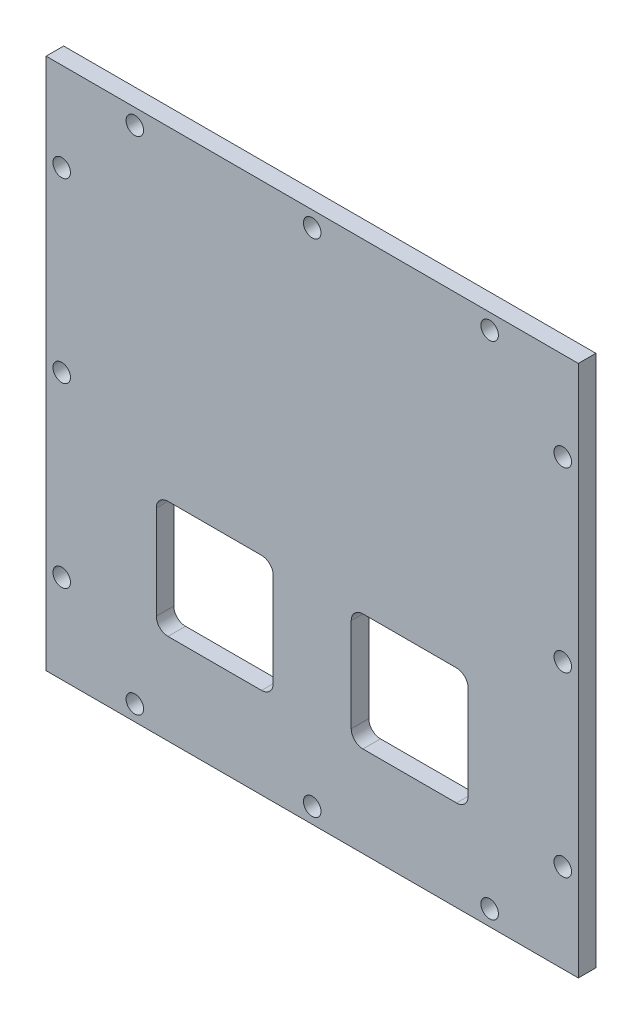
ISO-10303-21;
HEADER;
FILE_DESCRIPTION(('STEP AP214'),'2;1');
FILE_NAME('part.step','',(''),(''),'','','');
FILE_SCHEMA(('AUTOMOTIVE_DESIGN { 1 0 10303 214 1 1 1 1 }'));
ENDSEC;
DATA;
#1=APPLICATION_CONTEXT('core data for automotive mechanical design processes');
#2=APPLICATION_PROTOCOL_DEFINITION('international standard','automotive_design',2000,#1);
#3=PRODUCT_CONTEXT('',#1,'mechanical');
#4=PRODUCT('Part','Part','',(#3));
#5=PRODUCT_RELATED_PRODUCT_CATEGORY('part','',(#4));
#6=PRODUCT_DEFINITION_FORMATION('','',#4);
#7=PRODUCT_DEFINITION_CONTEXT('part definition',#1,'design');
#8=PRODUCT_DEFINITION('design','',#6,#7);
#9=PRODUCT_DEFINITION_SHAPE('','',#8);
#10=(LENGTH_UNIT() NAMED_UNIT(*) SI_UNIT(.MILLI.,.METRE.));
#11=(NAMED_UNIT(*) PLANE_ANGLE_UNIT() SI_UNIT($,.RADIAN.));
#12=(NAMED_UNIT(*) SI_UNIT($,.STERADIAN.) SOLID_ANGLE_UNIT());
#13=UNCERTAINTY_MEASURE_WITH_UNIT(LENGTH_MEASURE(1.E-05),#10,'distance_accuracy_value','');
#14=(GEOMETRIC_REPRESENTATION_CONTEXT(3) GLOBAL_UNCERTAINTY_ASSIGNED_CONTEXT((#13)) GLOBAL_UNIT_ASSIGNED_CONTEXT((#10,
#11,#12)) REPRESENTATION_CONTEXT('',''));
#15=CARTESIAN_POINT('',(0.,0.,0.));
#16=DIRECTION('',(0.,0.,1.));
#17=DIRECTION('',(1.,0.,0.));
#18=AXIS2_PLACEMENT_3D('',#15,#16,#17);
#19=CARTESIAN_POINT('',(-68.25,68.25,4.5));
#20=DIRECTION('',(1.,0.,0.));
#21=DIRECTION('',(0.,0.,-1.));
#22=AXIS2_PLACEMENT_3D('',#19,#20,#21);
#23=PLANE('',#22);
#24=DIRECTION('',(0.,-1.,0.));
#25=VECTOR('',#24,1.);
#26=CARTESIAN_POINT('',(-68.25,68.25,0.));
#27=LINE('',#26,#25);
#28=CARTESIAN_POINT('',(-68.25,68.25,0.));
#29=VERTEX_POINT('',#28);
#30=CARTESIAN_POINT('',(-68.25,-68.25,0.));
#31=VERTEX_POINT('',#30);
#32=EDGE_CURVE('E362',#29,#31,#27,.T.);
#33=ORIENTED_EDGE('',*,*,#32,.T.);
#34=DIRECTION('',(0.,0.,-1.));
#35=VECTOR('',#34,1.);
#36=CARTESIAN_POINT('',(-68.25,-68.25,4.5));
#37=LINE('',#36,#35);
#38=CARTESIAN_POINT('',(-68.25,-68.25,4.5));
#39=VERTEX_POINT('',#38);
#40=EDGE_CURVE('E11',#39,#31,#37,.T.);
#41=ORIENTED_EDGE('',*,*,#40,.F.);
#42=DIRECTION('',(0.,-1.,0.));
#43=VECTOR('',#42,1.);
#44=CARTESIAN_POINT('',(-68.25,68.25,4.5));
#45=LINE('',#44,#43);
#46=CARTESIAN_POINT('',(-68.25,68.25,4.5));
#47=VERTEX_POINT('',#46);
#48=EDGE_CURVE('E363',#47,#39,#45,.T.);
#49=ORIENTED_EDGE('',*,*,#48,.F.);
#50=DIRECTION('',(0.,0.,-1.));
#51=VECTOR('',#50,1.);
#52=CARTESIAN_POINT('',(-68.25,68.25,4.5));
#53=LINE('',#52,#51);
#54=EDGE_CURVE('E373',#47,#29,#53,.T.);
#55=ORIENTED_EDGE('',*,*,#54,.T.);
#56=EDGE_LOOP('',(#33,#41,#49,#55));
#57=FACE_BOUND('',#56,.T.);
#58=ADVANCED_FACE('F33',(#57),#23,.F.);
#59=CARTESIAN_POINT('',(-68.25,-68.25,4.5));
#60=DIRECTION('',(0.,1.,0.));
#61=DIRECTION('',(0.,0.,1.));
#62=AXIS2_PLACEMENT_3D('',#59,#60,#61);
#63=PLANE('',#62);
#64=DIRECTION('',(1.,0.,0.));
#65=VECTOR('',#64,1.);
#66=CARTESIAN_POINT('',(-68.25,-68.25,0.));
#67=LINE('',#66,#65);
#68=CARTESIAN_POINT('',(68.25,-68.25,0.));
#69=VERTEX_POINT('',#68);
#70=EDGE_CURVE('E376',#31,#69,#67,.T.);
#71=ORIENTED_EDGE('',*,*,#70,.T.);
#72=DIRECTION('',(0.,0.,-1.));
#73=VECTOR('',#72,1.);
#74=CARTESIAN_POINT('',(68.25,-68.25,4.5));
#75=LINE('',#74,#73);
#76=CARTESIAN_POINT('',(68.25,-68.25,4.5));
#77=VERTEX_POINT('',#76);
#78=EDGE_CURVE('E40',#77,#69,#75,.T.);
#79=ORIENTED_EDGE('',*,*,#78,.F.);
#80=DIRECTION('',(1.,0.,0.));
#81=VECTOR('',#80,1.);
#82=CARTESIAN_POINT('',(-68.25,-68.25,4.5));
#83=LINE('',#82,#81);
#84=EDGE_CURVE('E366',#39,#77,#83,.T.);
#85=ORIENTED_EDGE('',*,*,#84,.F.);
#86=ORIENTED_EDGE('',*,*,#40,.T.);
#87=EDGE_LOOP('',(#71,#79,#85,#86));
#88=FACE_BOUND('',#87,.T.);
#89=ADVANCED_FACE('F405',(#88),#63,.F.);
#90=CARTESIAN_POINT('',(68.25,68.25,4.5));
#91=DIRECTION('',(-1.,0.,0.));
#92=DIRECTION('',(0.,0.,1.));
#93=AXIS2_PLACEMENT_3D('',#90,#91,#92);
#94=PLANE('',#93);
#95=DIRECTION('',(0.,1.,0.));
#96=VECTOR('',#95,1.);
#97=CARTESIAN_POINT('',(68.25,68.25,0.));
#98=LINE('',#97,#96);
#99=CARTESIAN_POINT('',(68.25,68.25,0.));
#100=VERTEX_POINT('',#99);
#101=EDGE_CURVE('E378',#69,#100,#98,.T.);
#102=ORIENTED_EDGE('',*,*,#101,.T.);
#103=DIRECTION('',(0.,0.,-1.));
#104=VECTOR('',#103,1.);
#105=CARTESIAN_POINT('',(68.25,68.25,4.5));
#106=LINE('',#105,#104);
#107=CARTESIAN_POINT('',(68.25,68.25,4.5));
#108=VERTEX_POINT('',#107);
#109=EDGE_CURVE('E383',#108,#100,#106,.T.);
#110=ORIENTED_EDGE('',*,*,#109,.F.);
#111=DIRECTION('',(0.,1.,0.));
#112=VECTOR('',#111,1.);
#113=CARTESIAN_POINT('',(68.25,68.25,4.5));
#114=LINE('',#113,#112);
#115=EDGE_CURVE('E369',#77,#108,#114,.T.);
#116=ORIENTED_EDGE('',*,*,#115,.F.);
#117=ORIENTED_EDGE('',*,*,#78,.T.);
#118=EDGE_LOOP('',(#102,#110,#116,#117));
#119=FACE_BOUND('',#118,.T.);
#120=ADVANCED_FACE('F390',(#119),#94,.F.);
#121=CARTESIAN_POINT('',(-68.25,68.25,4.5));
#122=DIRECTION('',(0.,-1.,0.));
#123=DIRECTION('',(0.,0.,-1.));
#124=AXIS2_PLACEMENT_3D('',#121,#122,#123);
#125=PLANE('',#124);
#126=DIRECTION('',(-1.,0.,0.));
#127=VECTOR('',#126,1.);
#128=CARTESIAN_POINT('',(-68.25,68.25,0.));
#129=LINE('',#128,#127);
#130=EDGE_CURVE('E367',#100,#29,#129,.T.);
#131=ORIENTED_EDGE('',*,*,#130,.T.);
#132=ORIENTED_EDGE('',*,*,#54,.F.);
#133=DIRECTION('',(-1.,0.,0.));
#134=VECTOR('',#133,1.);
#135=CARTESIAN_POINT('',(-68.25,68.25,4.5));
#136=LINE('',#135,#134);
#137=EDGE_CURVE('E371',#108,#47,#136,.T.);
#138=ORIENTED_EDGE('',*,*,#137,.F.);
#139=ORIENTED_EDGE('',*,*,#109,.T.);
#140=EDGE_LOOP('',(#131,#132,#138,#139));
#141=FACE_BOUND('',#140,.T.);
#142=ADVANCED_FACE('F398',(#141),#125,.F.);
#143=CARTESIAN_POINT('',(0.,0.,4.5));
#144=DIRECTION('',(0.,0.,1.));
#145=DIRECTION('',(1.,0.,0.));
#146=AXIS2_PLACEMENT_3D('',#143,#144,#145);
#147=PLANE('',#146);
#148=CARTESIAN_POINT('',(-13.,-18.,4.5));
#149=DIRECTION('',(0.,0.,1.));
#150=DIRECTION('',(-1.,0.,0.));
#151=AXIS2_PLACEMENT_3D('',#148,#149,#150);
#152=CIRCLE('',#151,3.);
#153=CARTESIAN_POINT('',(-10.,-18.,4.5));
#154=VERTEX_POINT('',#153);
#155=CARTESIAN_POINT('',(-13.,-15.,4.5));
#156=VERTEX_POINT('',#155);
#157=EDGE_CURVE('E47',#154,#156,#152,.T.);
#158=ORIENTED_EDGE('',*,*,#157,.F.);
#159=DIRECTION('',(0.,1.,0.));
#160=VECTOR('',#159,1.);
#161=CARTESIAN_POINT('',(-10.,-18.,4.5));
#162=LINE('',#161,#160);
#163=CARTESIAN_POINT('',(-10.,-42.,4.5));
#164=VERTEX_POINT('',#163);
#165=EDGE_CURVE('E177',#164,#154,#162,.T.);
#166=ORIENTED_EDGE('',*,*,#165,.F.);
#167=CARTESIAN_POINT('',(-13.,-42.,4.5));
#168=DIRECTION('',(0.,0.,1.));
#169=DIRECTION('',(1.,0.,0.));
#170=AXIS2_PLACEMENT_3D('',#167,#168,#169);
#171=CIRCLE('',#170,3.);
#172=CARTESIAN_POINT('',(-13.,-45.,4.5));
#173=VERTEX_POINT('',#172);
#174=EDGE_CURVE('E211',#173,#164,#171,.T.);
#175=ORIENTED_EDGE('',*,*,#174,.F.);
#176=DIRECTION('',(1.,0.,0.));
#177=VECTOR('',#176,1.);
#178=CARTESIAN_POINT('',(-37.,-45.,4.5));
#179=LINE('',#178,#177);
#180=CARTESIAN_POINT('',(-37.,-45.,4.5));
#181=VERTEX_POINT('',#180);
#182=EDGE_CURVE('E208',#181,#173,#179,.T.);
#183=ORIENTED_EDGE('',*,*,#182,.F.);
#184=CARTESIAN_POINT('',(-37.,-42.,4.5));
#185=DIRECTION('',(0.,0.,1.));
#186=DIRECTION('',(1.,0.,0.));
#187=AXIS2_PLACEMENT_3D('',#184,#185,#186);
#188=CIRCLE('',#187,3.00000000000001);
#189=CARTESIAN_POINT('',(-40.,-42.,4.5));
#190=VERTEX_POINT('',#189);
#191=EDGE_CURVE('E205',#190,#181,#188,.T.);
#192=ORIENTED_EDGE('',*,*,#191,.F.);
#193=DIRECTION('',(0.,-1.,0.));
#194=VECTOR('',#193,1.);
#195=CARTESIAN_POINT('',(-40.,-18.,4.5));
#196=LINE('',#195,#194);
#197=CARTESIAN_POINT('',(-40.,-18.,4.5));
#198=VERTEX_POINT('',#197);
#199=EDGE_CURVE('E202',#198,#190,#196,.T.);
#200=ORIENTED_EDGE('',*,*,#199,.F.);
#201=CARTESIAN_POINT('',(-37.,-18.,4.5));
#202=DIRECTION('',(0.,0.,1.));
#203=DIRECTION('',(1.,0.,0.));
#204=AXIS2_PLACEMENT_3D('',#201,#202,#203);
#205=CIRCLE('',#204,3.);
#206=CARTESIAN_POINT('',(-37.,-15.,4.5));
#207=VERTEX_POINT('',#206);
#208=EDGE_CURVE('E199',#207,#198,#205,.T.);
#209=ORIENTED_EDGE('',*,*,#208,.F.);
#210=DIRECTION('',(-1.,0.,0.));
#211=VECTOR('',#210,1.);
#212=CARTESIAN_POINT('',(-37.,-15.,4.5));
#213=LINE('',#212,#211);
#214=EDGE_CURVE('E192',#156,#207,#213,.T.);
#215=ORIENTED_EDGE('',*,*,#214,.F.);
#216=EDGE_LOOP('',(#158,#166,#175,#183,#192,#200,#209,#215));
#217=FACE_BOUND('',#216,.T.);
#218=CARTESIAN_POINT('',(37.,-18.,4.5));
#219=DIRECTION('',(0.,0.,1.));
#220=DIRECTION('',(1.,0.,0.));
#221=AXIS2_PLACEMENT_3D('',#218,#219,#220);
#222=CIRCLE('',#221,3.);
#223=CARTESIAN_POINT('',(40.,-18.,4.5));
#224=VERTEX_POINT('',#223);
#225=CARTESIAN_POINT('',(37.,-15.,4.5));
#226=VERTEX_POINT('',#225);
#227=EDGE_CURVE('E247',#224,#226,#222,.T.);
#228=ORIENTED_EDGE('',*,*,#227,.F.);
#229=DIRECTION('',(0.,1.,0.));
#230=VECTOR('',#229,1.);
#231=CARTESIAN_POINT('',(40.,-18.,4.5));
#232=LINE('',#231,#230);
#233=CARTESIAN_POINT('',(40.,-42.,4.5));
#234=VERTEX_POINT('',#233);
#235=EDGE_CURVE('E267',#234,#224,#232,.T.);
#236=ORIENTED_EDGE('',*,*,#235,.F.);
#237=CARTESIAN_POINT('',(37.,-42.,4.5));
#238=DIRECTION('',(0.,0.,1.));
#239=DIRECTION('',(-1.,0.,0.));
#240=AXIS2_PLACEMENT_3D('',#237,#238,#239);
#241=CIRCLE('',#240,3.00000000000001);
#242=CARTESIAN_POINT('',(37.,-45.,4.5));
#243=VERTEX_POINT('',#242);
#244=EDGE_CURVE('E264',#243,#234,#241,.T.);
#245=ORIENTED_EDGE('',*,*,#244,.F.);
#246=DIRECTION('',(1.,0.,0.));
#247=VECTOR('',#246,1.);
#248=CARTESIAN_POINT('',(37.,-45.,4.5));
#249=LINE('',#248,#247);
#250=CARTESIAN_POINT('',(13.,-45.,4.5));
#251=VERTEX_POINT('',#250);
#252=EDGE_CURVE('E261',#251,#243,#249,.T.);
#253=ORIENTED_EDGE('',*,*,#252,.F.);
#254=CARTESIAN_POINT('',(13.,-42.,4.5));
#255=DIRECTION('',(0.,0.,1.));
#256=DIRECTION('',(1.,0.,0.));
#257=AXIS2_PLACEMENT_3D('',#254,#255,#256);
#258=CIRCLE('',#257,3.);
#259=CARTESIAN_POINT('',(10.,-42.,4.5));
#260=VERTEX_POINT('',#259);
#261=EDGE_CURVE('E258',#260,#251,#258,.T.);
#262=ORIENTED_EDGE('',*,*,#261,.F.);
#263=DIRECTION('',(0.,-1.,0.));
#264=VECTOR('',#263,1.);
#265=CARTESIAN_POINT('',(10.,-18.,4.5));
#266=LINE('',#265,#264);
#267=CARTESIAN_POINT('',(10.,-18.,4.5));
#268=VERTEX_POINT('',#267);
#269=EDGE_CURVE('E255',#268,#260,#266,.T.);
#270=ORIENTED_EDGE('',*,*,#269,.F.);
#271=CARTESIAN_POINT('',(13.,-18.,4.5));
#272=DIRECTION('',(0.,0.,1.));
#273=DIRECTION('',(1.,0.,0.));
#274=AXIS2_PLACEMENT_3D('',#271,#272,#273);
#275=CIRCLE('',#274,3.);
#276=CARTESIAN_POINT('',(13.,-15.,4.5));
#277=VERTEX_POINT('',#276);
#278=EDGE_CURVE('E252',#277,#268,#275,.T.);
#279=ORIENTED_EDGE('',*,*,#278,.F.);
#280=DIRECTION('',(-1.,0.,0.));
#281=VECTOR('',#280,1.);
#282=CARTESIAN_POINT('',(37.,-15.,4.5));
#283=LINE('',#282,#281);
#284=EDGE_CURVE('E249',#226,#277,#283,.T.);
#285=ORIENTED_EDGE('',*,*,#284,.F.);
#286=EDGE_LOOP('',(#228,#236,#245,#253,#262,#270,#279,#285));
#287=FACE_BOUND('',#286,.T.);
#288=CARTESIAN_POINT('',(-64.25,45.5,4.5));
#289=DIRECTION('',(0.,0.,1.));
#290=DIRECTION('',(1.,0.,0.));
#291=AXIS2_PLACEMENT_3D('',#288,#289,#290);
#292=CIRCLE('',#291,2.25);
#293=CARTESIAN_POINT('',(-62.,45.5,4.5));
#294=VERTEX_POINT('',#293);
#295=EDGE_CURVE('E290',#294,#294,#292,.T.);
#296=ORIENTED_EDGE('',*,*,#295,.F.);
#297=EDGE_LOOP('',(#296));
#298=FACE_BOUND('',#297,.T.);
#299=CARTESIAN_POINT('',(-64.25,0.,4.5));
#300=DIRECTION('',(0.,0.,1.));
#301=DIRECTION('',(1.,0.,0.));
#302=AXIS2_PLACEMENT_3D('',#299,#300,#301);
#303=CIRCLE('',#302,2.25);
#304=CARTESIAN_POINT('',(-62.,0.,4.5));
#305=VERTEX_POINT('',#304);
#306=EDGE_CURVE('E296',#305,#305,#303,.T.);
#307=ORIENTED_EDGE('',*,*,#306,.F.);
#308=EDGE_LOOP('',(#307));
#309=FACE_BOUND('',#308,.T.);
#310=CARTESIAN_POINT('',(-64.25,-45.5,4.5));
#311=DIRECTION('',(0.,0.,1.));
#312=DIRECTION('',(1.,0.,0.));
#313=AXIS2_PLACEMENT_3D('',#310,#311,#312);
#314=CIRCLE('',#313,2.25);
#315=CARTESIAN_POINT('',(-62.,-45.5,4.5));
#316=VERTEX_POINT('',#315);
#317=EDGE_CURVE('E302',#316,#316,#314,.T.);
#318=ORIENTED_EDGE('',*,*,#317,.F.);
#319=EDGE_LOOP('',(#318));
#320=FACE_BOUND('',#319,.T.);
#321=CARTESIAN_POINT('',(-45.5,64.25,4.5));
#322=DIRECTION('',(0.,0.,1.));
#323=DIRECTION('',(1.,0.,0.));
#324=AXIS2_PLACEMENT_3D('',#321,#322,#323);
#325=CIRCLE('',#324,2.25);
#326=CARTESIAN_POINT('',(-43.25,64.25,4.5));
#327=VERTEX_POINT('',#326);
#328=EDGE_CURVE('E308',#327,#327,#325,.T.);
#329=ORIENTED_EDGE('',*,*,#328,.F.);
#330=EDGE_LOOP('',(#329));
#331=FACE_BOUND('',#330,.T.);
#332=CARTESIAN_POINT('',(0.,64.25,4.5));
#333=DIRECTION('',(0.,0.,1.));
#334=DIRECTION('',(1.,0.,0.));
#335=AXIS2_PLACEMENT_3D('',#332,#333,#334);
#336=CIRCLE('',#335,2.25);
#337=CARTESIAN_POINT('',(2.25,64.25,4.5));
#338=VERTEX_POINT('',#337);
#339=EDGE_CURVE('E314',#338,#338,#336,.T.);
#340=ORIENTED_EDGE('',*,*,#339,.F.);
#341=EDGE_LOOP('',(#340));
#342=FACE_BOUND('',#341,.T.);
#343=CARTESIAN_POINT('',(45.5,64.25,4.5));
#344=DIRECTION('',(0.,0.,1.));
#345=DIRECTION('',(1.,0.,0.));
#346=AXIS2_PLACEMENT_3D('',#343,#344,#345);
#347=CIRCLE('',#346,2.25);
#348=CARTESIAN_POINT('',(47.75,64.25,4.5));
#349=VERTEX_POINT('',#348);
#350=EDGE_CURVE('E320',#349,#349,#347,.T.);
#351=ORIENTED_EDGE('',*,*,#350,.F.);
#352=EDGE_LOOP('',(#351));
#353=FACE_BOUND('',#352,.T.);
#354=CARTESIAN_POINT('',(64.25,-45.5,4.5));
#355=DIRECTION('',(0.,0.,1.));
#356=DIRECTION('',(1.,0.,0.));
#357=AXIS2_PLACEMENT_3D('',#354,#355,#356);
#358=CIRCLE('',#357,2.25);
#359=CARTESIAN_POINT('',(66.5,-45.5,4.5));
#360=VERTEX_POINT('',#359);
#361=EDGE_CURVE('E326',#360,#360,#358,.T.);
#362=ORIENTED_EDGE('',*,*,#361,.F.);
#363=EDGE_LOOP('',(#362));
#364=FACE_BOUND('',#363,.T.);
#365=CARTESIAN_POINT('',(64.25,0.,4.5));
#366=DIRECTION('',(0.,0.,1.));
#367=DIRECTION('',(1.,0.,0.));
#368=AXIS2_PLACEMENT_3D('',#365,#366,#367);
#369=CIRCLE('',#368,2.25);
#370=CARTESIAN_POINT('',(66.5,0.,4.5));
#371=VERTEX_POINT('',#370);
#372=EDGE_CURVE('E332',#371,#371,#369,.T.);
#373=ORIENTED_EDGE('',*,*,#372,.F.);
#374=EDGE_LOOP('',(#373));
#375=FACE_BOUND('',#374,.T.);
#376=CARTESIAN_POINT('',(64.25,45.5,4.5));
#377=DIRECTION('',(0.,0.,1.));
#378=DIRECTION('',(1.,0.,0.));
#379=AXIS2_PLACEMENT_3D('',#376,#377,#378);
#380=CIRCLE('',#379,2.25);
#381=CARTESIAN_POINT('',(66.5,45.5,4.5));
#382=VERTEX_POINT('',#381);
#383=EDGE_CURVE('E338',#382,#382,#380,.T.);
#384=ORIENTED_EDGE('',*,*,#383,.F.);
#385=EDGE_LOOP('',(#384));
#386=FACE_BOUND('',#385,.T.);
#387=CARTESIAN_POINT('',(45.5,-64.25,4.5));
#388=DIRECTION('',(0.,0.,1.));
#389=DIRECTION('',(1.,0.,0.));
#390=AXIS2_PLACEMENT_3D('',#387,#388,#389);
#391=CIRCLE('',#390,2.25);
#392=CARTESIAN_POINT('',(47.75,-64.25,4.5));
#393=VERTEX_POINT('',#392);
#394=EDGE_CURVE('E344',#393,#393,#391,.T.);
#395=ORIENTED_EDGE('',*,*,#394,.F.);
#396=EDGE_LOOP('',(#395));
#397=FACE_BOUND('',#396,.T.);
#398=CARTESIAN_POINT('',(0.,-64.25,4.5));
#399=DIRECTION('',(0.,0.,1.));
#400=DIRECTION('',(1.,0.,0.));
#401=AXIS2_PLACEMENT_3D('',#398,#399,#400);
#402=CIRCLE('',#401,2.25);
#403=CARTESIAN_POINT('',(2.25,-64.25,4.5));
#404=VERTEX_POINT('',#403);
#405=EDGE_CURVE('E350',#404,#404,#402,.T.);
#406=ORIENTED_EDGE('',*,*,#405,.F.);
#407=EDGE_LOOP('',(#406));
#408=FACE_BOUND('',#407,.T.);
#409=CARTESIAN_POINT('',(-45.5,-64.25,4.5));
#410=DIRECTION('',(0.,0.,1.));
#411=DIRECTION('',(1.,0.,0.));
#412=AXIS2_PLACEMENT_3D('',#409,#410,#411);
#413=CIRCLE('',#412,2.25);
#414=CARTESIAN_POINT('',(-43.25,-64.25,4.5));
#415=VERTEX_POINT('',#414);
#416=EDGE_CURVE('E356',#415,#415,#413,.T.);
#417=ORIENTED_EDGE('',*,*,#416,.F.);
#418=EDGE_LOOP('',(#417));
#419=FACE_BOUND('',#418,.T.);
#420=ORIENTED_EDGE('',*,*,#48,.T.);
#421=ORIENTED_EDGE('',*,*,#84,.T.);
#422=ORIENTED_EDGE('',*,*,#115,.T.);
#423=ORIENTED_EDGE('',*,*,#137,.T.);
#424=EDGE_LOOP('',(#420,#421,#422,#423));
#425=FACE_BOUND('',#424,.T.);
#426=ADVANCED_FACE('F404',(#217,#287,#298,#309,#320,#331,#342,#353,#364,#375,#386,#397,#408,
#419,#425),#147,.T.);
#427=CARTESIAN_POINT('',(0.,0.,0.));
#428=DIRECTION('',(0.,0.,1.));
#429=DIRECTION('',(1.,0.,0.));
#430=AXIS2_PLACEMENT_3D('',#427,#428,#429);
#431=PLANE('',#430);
#432=DIRECTION('',(0.,-1.,0.));
#433=VECTOR('',#432,1.);
#434=CARTESIAN_POINT('',(-10.,-18.,0.));
#435=LINE('',#434,#433);
#436=CARTESIAN_POINT('',(-10.,-18.,0.));
#437=VERTEX_POINT('',#436);
#438=CARTESIAN_POINT('',(-10.,-42.,0.));
#439=VERTEX_POINT('',#438);
#440=EDGE_CURVE('E190',#437,#439,#435,.T.);
#441=ORIENTED_EDGE('',*,*,#440,.F.);
#442=CARTESIAN_POINT('',(-13.,-18.,0.));
#443=DIRECTION('',(0.,0.,1.));
#444=DIRECTION('',(1.,0.,0.));
#445=AXIS2_PLACEMENT_3D('',#442,#443,#444);
#446=CIRCLE('',#445,3.);
#447=CARTESIAN_POINT('',(-13.,-15.,0.));
#448=VERTEX_POINT('',#447);
#449=EDGE_CURVE('E171',#448,#437,#446,.F.);
#450=ORIENTED_EDGE('',*,*,#449,.F.);
#451=DIRECTION('',(1.,0.,0.));
#452=VECTOR('',#451,1.);
#453=CARTESIAN_POINT('',(-37.,-15.,0.));
#454=LINE('',#453,#452);
#455=CARTESIAN_POINT('',(-37.,-15.,0.));
#456=VERTEX_POINT('',#455);
#457=EDGE_CURVE('E180',#456,#448,#454,.T.);
#458=ORIENTED_EDGE('',*,*,#457,.F.);
#459=CARTESIAN_POINT('',(-37.,-18.,0.));
#460=DIRECTION('',(0.,0.,1.));
#461=DIRECTION('',(1.,0.,0.));
#462=AXIS2_PLACEMENT_3D('',#459,#460,#461);
#463=CIRCLE('',#462,3.);
#464=CARTESIAN_POINT('',(-40.,-18.,0.));
#465=VERTEX_POINT('',#464);
#466=EDGE_CURVE('E55',#465,#456,#463,.F.);
#467=ORIENTED_EDGE('',*,*,#466,.F.);
#468=DIRECTION('',(0.,1.,0.));
#469=VECTOR('',#468,1.);
#470=CARTESIAN_POINT('',(-40.,-18.,0.));
#471=LINE('',#470,#469);
#472=CARTESIAN_POINT('',(-40.,-42.,0.));
#473=VERTEX_POINT('',#472);
#474=EDGE_CURVE('E538',#473,#465,#471,.T.);
#475=ORIENTED_EDGE('',*,*,#474,.F.);
#476=CARTESIAN_POINT('',(-37.,-42.,0.));
#477=DIRECTION('',(0.,0.,1.));
#478=DIRECTION('',(1.,0.,0.));
#479=AXIS2_PLACEMENT_3D('',#476,#477,#478);
#480=CIRCLE('',#479,3.00000000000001);
#481=CARTESIAN_POINT('',(-37.,-45.,0.));
#482=VERTEX_POINT('',#481);
#483=EDGE_CURVE('E533',#482,#473,#480,.F.);
#484=ORIENTED_EDGE('',*,*,#483,.F.);
#485=DIRECTION('',(-1.,0.,0.));
#486=VECTOR('',#485,1.);
#487=CARTESIAN_POINT('',(-37.,-45.,0.));
#488=LINE('',#487,#486);
#489=CARTESIAN_POINT('',(-13.,-45.,0.));
#490=VERTEX_POINT('',#489);
#491=EDGE_CURVE('E532',#490,#482,#488,.T.);
#492=ORIENTED_EDGE('',*,*,#491,.F.);
#493=CARTESIAN_POINT('',(-13.,-42.,0.));
#494=DIRECTION('',(0.,0.,1.));
#495=DIRECTION('',(1.,0.,0.));
#496=AXIS2_PLACEMENT_3D('',#493,#494,#495);
#497=CIRCLE('',#496,3.);
#498=EDGE_CURVE('E194',#439,#490,#497,.F.);
#499=ORIENTED_EDGE('',*,*,#498,.F.);
#500=EDGE_LOOP('',(#441,#450,#458,#467,#475,#484,#492,#499));
#501=FACE_BOUND('',#500,.T.);
#502=DIRECTION('',(0.,-1.,0.));
#503=VECTOR('',#502,1.);
#504=CARTESIAN_POINT('',(40.,-18.,0.));
#505=LINE('',#504,#503);
#506=CARTESIAN_POINT('',(40.,-18.,0.));
#507=VERTEX_POINT('',#506);
#508=CARTESIAN_POINT('',(40.,-42.,0.));
#509=VERTEX_POINT('',#508);
#510=EDGE_CURVE('E241',#507,#509,#505,.T.);
#511=ORIENTED_EDGE('',*,*,#510,.F.);
#512=CARTESIAN_POINT('',(37.,-18.,0.));
#513=DIRECTION('',(0.,0.,1.));
#514=DIRECTION('',(1.,0.,0.));
#515=AXIS2_PLACEMENT_3D('',#512,#513,#514);
#516=CIRCLE('',#515,3.);
#517=CARTESIAN_POINT('',(37.,-15.,0.));
#518=VERTEX_POINT('',#517);
#519=EDGE_CURVE('E244',#518,#507,#516,.F.);
#520=ORIENTED_EDGE('',*,*,#519,.F.);
#521=DIRECTION('',(1.,0.,0.));
#522=VECTOR('',#521,1.);
#523=CARTESIAN_POINT('',(37.,-15.,0.));
#524=LINE('',#523,#522);
#525=CARTESIAN_POINT('',(13.,-15.,0.));
#526=VERTEX_POINT('',#525);
#527=EDGE_CURVE('E273',#526,#518,#524,.T.);
#528=ORIENTED_EDGE('',*,*,#527,.F.);
#529=CARTESIAN_POINT('',(13.,-18.,0.));
#530=DIRECTION('',(0.,0.,1.));
#531=DIRECTION('',(1.,0.,0.));
#532=AXIS2_PLACEMENT_3D('',#529,#530,#531);
#533=CIRCLE('',#532,3.);
#534=CARTESIAN_POINT('',(10.,-18.,0.));
#535=VERTEX_POINT('',#534);
#536=EDGE_CURVE('E183',#535,#526,#533,.F.);
#537=ORIENTED_EDGE('',*,*,#536,.F.);
#538=DIRECTION('',(0.,1.,0.));
#539=VECTOR('',#538,1.);
#540=CARTESIAN_POINT('',(10.,-18.,0.));
#541=LINE('',#540,#539);
#542=CARTESIAN_POINT('',(10.,-42.,0.));
#543=VERTEX_POINT('',#542);
#544=EDGE_CURVE('E229',#543,#535,#541,.T.);
#545=ORIENTED_EDGE('',*,*,#544,.F.);
#546=CARTESIAN_POINT('',(13.,-42.,0.));
#547=DIRECTION('',(0.,0.,1.));
#548=DIRECTION('',(1.,0.,0.));
#549=AXIS2_PLACEMENT_3D('',#546,#547,#548);
#550=CIRCLE('',#549,3.);
#551=CARTESIAN_POINT('',(13.,-45.,0.));
#552=VERTEX_POINT('',#551);
#553=EDGE_CURVE('E232',#552,#543,#550,.F.);
#554=ORIENTED_EDGE('',*,*,#553,.F.);
#555=DIRECTION('',(-1.,0.,0.));
#556=VECTOR('',#555,1.);
#557=CARTESIAN_POINT('',(37.,-45.,0.));
#558=LINE('',#557,#556);
#559=CARTESIAN_POINT('',(37.,-45.,0.));
#560=VERTEX_POINT('',#559);
#561=EDGE_CURVE('E235',#560,#552,#558,.T.);
#562=ORIENTED_EDGE('',*,*,#561,.F.);
#563=CARTESIAN_POINT('',(37.,-42.,0.));
#564=DIRECTION('',(0.,0.,1.));
#565=DIRECTION('',(1.,0.,0.));
#566=AXIS2_PLACEMENT_3D('',#563,#564,#565);
#567=CIRCLE('',#566,3.00000000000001);
#568=EDGE_CURVE('E238',#509,#560,#567,.F.);
#569=ORIENTED_EDGE('',*,*,#568,.F.);
#570=EDGE_LOOP('',(#511,#520,#528,#537,#545,#554,#562,#569));
#571=FACE_BOUND('',#570,.T.);
#572=CARTESIAN_POINT('',(-64.25,45.5,0.));
#573=DIRECTION('',(0.,0.,1.));
#574=DIRECTION('',(1.,0.,0.));
#575=AXIS2_PLACEMENT_3D('',#572,#573,#574);
#576=CIRCLE('',#575,2.25);
#577=CARTESIAN_POINT('',(-62.,45.5,0.));
#578=VERTEX_POINT('',#577);
#579=EDGE_CURVE('E293',#578,#578,#576,.T.);
#580=ORIENTED_EDGE('',*,*,#579,.T.);
#581=EDGE_LOOP('',(#580));
#582=FACE_BOUND('',#581,.T.);
#583=CARTESIAN_POINT('',(-64.25,0.,0.));
#584=DIRECTION('',(0.,0.,1.));
#585=DIRECTION('',(1.,0.,0.));
#586=AXIS2_PLACEMENT_3D('',#583,#584,#585);
#587=CIRCLE('',#586,2.25);
#588=CARTESIAN_POINT('',(-62.,0.,0.));
#589=VERTEX_POINT('',#588);
#590=EDGE_CURVE('E299',#589,#589,#587,.T.);
#591=ORIENTED_EDGE('',*,*,#590,.T.);
#592=EDGE_LOOP('',(#591));
#593=FACE_BOUND('',#592,.T.);
#594=CARTESIAN_POINT('',(-64.25,-45.5,0.));
#595=DIRECTION('',(0.,0.,1.));
#596=DIRECTION('',(1.,0.,0.));
#597=AXIS2_PLACEMENT_3D('',#594,#595,#596);
#598=CIRCLE('',#597,2.25);
#599=CARTESIAN_POINT('',(-62.,-45.5,0.));
#600=VERTEX_POINT('',#599);
#601=EDGE_CURVE('E305',#600,#600,#598,.T.);
#602=ORIENTED_EDGE('',*,*,#601,.T.);
#603=EDGE_LOOP('',(#602));
#604=FACE_BOUND('',#603,.T.);
#605=CARTESIAN_POINT('',(-45.5,64.25,0.));
#606=DIRECTION('',(0.,0.,1.));
#607=DIRECTION('',(1.,0.,0.));
#608=AXIS2_PLACEMENT_3D('',#605,#606,#607);
#609=CIRCLE('',#608,2.25);
#610=CARTESIAN_POINT('',(-43.25,64.25,0.));
#611=VERTEX_POINT('',#610);
#612=EDGE_CURVE('E311',#611,#611,#609,.T.);
#613=ORIENTED_EDGE('',*,*,#612,.T.);
#614=EDGE_LOOP('',(#613));
#615=FACE_BOUND('',#614,.T.);
#616=CARTESIAN_POINT('',(0.,64.25,0.));
#617=DIRECTION('',(0.,0.,1.));
#618=DIRECTION('',(1.,0.,0.));
#619=AXIS2_PLACEMENT_3D('',#616,#617,#618);
#620=CIRCLE('',#619,2.25);
#621=CARTESIAN_POINT('',(2.25,64.25,0.));
#622=VERTEX_POINT('',#621);
#623=EDGE_CURVE('E317',#622,#622,#620,.T.);
#624=ORIENTED_EDGE('',*,*,#623,.T.);
#625=EDGE_LOOP('',(#624));
#626=FACE_BOUND('',#625,.T.);
#627=CARTESIAN_POINT('',(45.5,64.25,0.));
#628=DIRECTION('',(0.,0.,1.));
#629=DIRECTION('',(1.,0.,0.));
#630=AXIS2_PLACEMENT_3D('',#627,#628,#629);
#631=CIRCLE('',#630,2.25);
#632=CARTESIAN_POINT('',(47.75,64.25,0.));
#633=VERTEX_POINT('',#632);
#634=EDGE_CURVE('E323',#633,#633,#631,.T.);
#635=ORIENTED_EDGE('',*,*,#634,.T.);
#636=EDGE_LOOP('',(#635));
#637=FACE_BOUND('',#636,.T.);
#638=CARTESIAN_POINT('',(64.25,-45.5,0.));
#639=DIRECTION('',(0.,0.,1.));
#640=DIRECTION('',(1.,0.,0.));
#641=AXIS2_PLACEMENT_3D('',#638,#639,#640);
#642=CIRCLE('',#641,2.25);
#643=CARTESIAN_POINT('',(66.5,-45.5,0.));
#644=VERTEX_POINT('',#643);
#645=EDGE_CURVE('E329',#644,#644,#642,.T.);
#646=ORIENTED_EDGE('',*,*,#645,.T.);
#647=EDGE_LOOP('',(#646));
#648=FACE_BOUND('',#647,.T.);
#649=CARTESIAN_POINT('',(64.25,0.,0.));
#650=DIRECTION('',(0.,0.,1.));
#651=DIRECTION('',(1.,0.,0.));
#652=AXIS2_PLACEMENT_3D('',#649,#650,#651);
#653=CIRCLE('',#652,2.25);
#654=CARTESIAN_POINT('',(66.5,0.,0.));
#655=VERTEX_POINT('',#654);
#656=EDGE_CURVE('E335',#655,#655,#653,.T.);
#657=ORIENTED_EDGE('',*,*,#656,.T.);
#658=EDGE_LOOP('',(#657));
#659=FACE_BOUND('',#658,.T.);
#660=CARTESIAN_POINT('',(64.25,45.5,0.));
#661=DIRECTION('',(0.,0.,1.));
#662=DIRECTION('',(1.,0.,0.));
#663=AXIS2_PLACEMENT_3D('',#660,#661,#662);
#664=CIRCLE('',#663,2.25);
#665=CARTESIAN_POINT('',(66.5,45.5,0.));
#666=VERTEX_POINT('',#665);
#667=EDGE_CURVE('E341',#666,#666,#664,.T.);
#668=ORIENTED_EDGE('',*,*,#667,.T.);
#669=EDGE_LOOP('',(#668));
#670=FACE_BOUND('',#669,.T.);
#671=CARTESIAN_POINT('',(45.5,-64.25,0.));
#672=DIRECTION('',(0.,0.,1.));
#673=DIRECTION('',(1.,0.,0.));
#674=AXIS2_PLACEMENT_3D('',#671,#672,#673);
#675=CIRCLE('',#674,2.25);
#676=CARTESIAN_POINT('',(47.75,-64.25,0.));
#677=VERTEX_POINT('',#676);
#678=EDGE_CURVE('E347',#677,#677,#675,.T.);
#679=ORIENTED_EDGE('',*,*,#678,.T.);
#680=EDGE_LOOP('',(#679));
#681=FACE_BOUND('',#680,.T.);
#682=CARTESIAN_POINT('',(0.,-64.25,0.));
#683=DIRECTION('',(0.,0.,1.));
#684=DIRECTION('',(1.,0.,0.));
#685=AXIS2_PLACEMENT_3D('',#682,#683,#684);
#686=CIRCLE('',#685,2.25);
#687=CARTESIAN_POINT('',(2.25,-64.25,0.));
#688=VERTEX_POINT('',#687);
#689=EDGE_CURVE('E353',#688,#688,#686,.T.);
#690=ORIENTED_EDGE('',*,*,#689,.T.);
#691=EDGE_LOOP('',(#690));
#692=FACE_BOUND('',#691,.T.);
#693=CARTESIAN_POINT('',(-45.5,-64.25,0.));
#694=DIRECTION('',(0.,0.,1.));
#695=DIRECTION('',(1.,0.,0.));
#696=AXIS2_PLACEMENT_3D('',#693,#694,#695);
#697=CIRCLE('',#696,2.25);
#698=CARTESIAN_POINT('',(-43.25,-64.25,0.));
#699=VERTEX_POINT('',#698);
#700=EDGE_CURVE('E359',#699,#699,#697,.T.);
#701=ORIENTED_EDGE('',*,*,#700,.T.);
#702=EDGE_LOOP('',(#701));
#703=FACE_BOUND('',#702,.T.);
#704=ORIENTED_EDGE('',*,*,#32,.F.);
#705=ORIENTED_EDGE('',*,*,#130,.F.);
#706=ORIENTED_EDGE('',*,*,#101,.F.);
#707=ORIENTED_EDGE('',*,*,#70,.F.);
#708=EDGE_LOOP('',(#704,#705,#706,#707));
#709=FACE_BOUND('',#708,.T.);
#710=ADVANCED_FACE('F186',(#501,#571,#582,#593,#604,#615,#626,#637,#648,#659,#670,#681,#692,
#703,#709),#431,.F.);
#711=CARTESIAN_POINT('',(-45.5,-64.25,4.5));
#712=DIRECTION('',(0.,0.,1.));
#713=DIRECTION('',(1.,0.,0.));
#714=AXIS2_PLACEMENT_3D('',#711,#712,#713);
#715=CYLINDRICAL_SURFACE('',#714,2.25);
#716=ORIENTED_EDGE('',*,*,#700,.F.);
#717=EDGE_LOOP('',(#716));
#718=FACE_BOUND('',#717,.T.);
#719=ORIENTED_EDGE('',*,*,#416,.T.);
#720=EDGE_LOOP('',(#719));
#721=FACE_BOUND('',#720,.T.);
#722=ADVANCED_FACE('F417',(#718,#721),#715,.F.);
#723=CARTESIAN_POINT('',(0.,-64.25,4.5));
#724=DIRECTION('',(0.,0.,1.));
#725=DIRECTION('',(1.,0.,0.));
#726=AXIS2_PLACEMENT_3D('',#723,#724,#725);
#727=CYLINDRICAL_SURFACE('',#726,2.25);
#728=ORIENTED_EDGE('',*,*,#689,.F.);
#729=EDGE_LOOP('',(#728));
#730=FACE_BOUND('',#729,.T.);
#731=ORIENTED_EDGE('',*,*,#405,.T.);
#732=EDGE_LOOP('',(#731));
#733=FACE_BOUND('',#732,.T.);
#734=ADVANCED_FACE('F423',(#730,#733),#727,.F.);
#735=CARTESIAN_POINT('',(45.5,-64.25,4.5));
#736=DIRECTION('',(0.,0.,1.));
#737=DIRECTION('',(1.,0.,0.));
#738=AXIS2_PLACEMENT_3D('',#735,#736,#737);
#739=CYLINDRICAL_SURFACE('',#738,2.25);
#740=ORIENTED_EDGE('',*,*,#678,.F.);
#741=EDGE_LOOP('',(#740));
#742=FACE_BOUND('',#741,.T.);
#743=ORIENTED_EDGE('',*,*,#394,.T.);
#744=EDGE_LOOP('',(#743));
#745=FACE_BOUND('',#744,.T.);
#746=ADVANCED_FACE('F427',(#742,#745),#739,.F.);
#747=CARTESIAN_POINT('',(64.25,45.5,4.5));
#748=DIRECTION('',(0.,0.,1.));
#749=DIRECTION('',(1.,0.,0.));
#750=AXIS2_PLACEMENT_3D('',#747,#748,#749);
#751=CYLINDRICAL_SURFACE('',#750,2.25);
#752=ORIENTED_EDGE('',*,*,#667,.F.);
#753=EDGE_LOOP('',(#752));
#754=FACE_BOUND('',#753,.T.);
#755=ORIENTED_EDGE('',*,*,#383,.T.);
#756=EDGE_LOOP('',(#755));
#757=FACE_BOUND('',#756,.T.);
#758=ADVANCED_FACE('F431',(#754,#757),#751,.F.);
#759=CARTESIAN_POINT('',(64.25,0.,4.5));
#760=DIRECTION('',(0.,0.,1.));
#761=DIRECTION('',(1.,0.,0.));
#762=AXIS2_PLACEMENT_3D('',#759,#760,#761);
#763=CYLINDRICAL_SURFACE('',#762,2.25);
#764=ORIENTED_EDGE('',*,*,#656,.F.);
#765=EDGE_LOOP('',(#764));
#766=FACE_BOUND('',#765,.T.);
#767=ORIENTED_EDGE('',*,*,#372,.T.);
#768=EDGE_LOOP('',(#767));
#769=FACE_BOUND('',#768,.T.);
#770=ADVANCED_FACE('F435',(#766,#769),#763,.F.);
#771=CARTESIAN_POINT('',(64.25,-45.5,4.5));
#772=DIRECTION('',(0.,0.,1.));
#773=DIRECTION('',(1.,0.,0.));
#774=AXIS2_PLACEMENT_3D('',#771,#772,#773);
#775=CYLINDRICAL_SURFACE('',#774,2.25);
#776=ORIENTED_EDGE('',*,*,#645,.F.);
#777=EDGE_LOOP('',(#776));
#778=FACE_BOUND('',#777,.T.);
#779=ORIENTED_EDGE('',*,*,#361,.T.);
#780=EDGE_LOOP('',(#779));
#781=FACE_BOUND('',#780,.T.);
#782=ADVANCED_FACE('F439',(#778,#781),#775,.F.);
#783=CARTESIAN_POINT('',(45.5,64.25,4.5));
#784=DIRECTION('',(0.,0.,1.));
#785=DIRECTION('',(1.,0.,0.));
#786=AXIS2_PLACEMENT_3D('',#783,#784,#785);
#787=CYLINDRICAL_SURFACE('',#786,2.25);
#788=ORIENTED_EDGE('',*,*,#634,.F.);
#789=EDGE_LOOP('',(#788));
#790=FACE_BOUND('',#789,.T.);
#791=ORIENTED_EDGE('',*,*,#350,.T.);
#792=EDGE_LOOP('',(#791));
#793=FACE_BOUND('',#792,.T.);
#794=ADVANCED_FACE('F443',(#790,#793),#787,.F.);
#795=CARTESIAN_POINT('',(0.,64.25,4.5));
#796=DIRECTION('',(0.,0.,1.));
#797=DIRECTION('',(1.,0.,0.));
#798=AXIS2_PLACEMENT_3D('',#795,#796,#797);
#799=CYLINDRICAL_SURFACE('',#798,2.25);
#800=ORIENTED_EDGE('',*,*,#623,.F.);
#801=EDGE_LOOP('',(#800));
#802=FACE_BOUND('',#801,.T.);
#803=ORIENTED_EDGE('',*,*,#339,.T.);
#804=EDGE_LOOP('',(#803));
#805=FACE_BOUND('',#804,.T.);
#806=ADVANCED_FACE('F447',(#802,#805),#799,.F.);
#807=CARTESIAN_POINT('',(-45.5,64.25,4.5));
#808=DIRECTION('',(0.,0.,1.));
#809=DIRECTION('',(1.,0.,0.));
#810=AXIS2_PLACEMENT_3D('',#807,#808,#809);
#811=CYLINDRICAL_SURFACE('',#810,2.25);
#812=ORIENTED_EDGE('',*,*,#612,.F.);
#813=EDGE_LOOP('',(#812));
#814=FACE_BOUND('',#813,.T.);
#815=ORIENTED_EDGE('',*,*,#328,.T.);
#816=EDGE_LOOP('',(#815));
#817=FACE_BOUND('',#816,.T.);
#818=ADVANCED_FACE('F451',(#814,#817),#811,.F.);
#819=CARTESIAN_POINT('',(-64.25,-45.5,4.5));
#820=DIRECTION('',(0.,0.,1.));
#821=DIRECTION('',(1.,0.,0.));
#822=AXIS2_PLACEMENT_3D('',#819,#820,#821);
#823=CYLINDRICAL_SURFACE('',#822,2.25);
#824=ORIENTED_EDGE('',*,*,#601,.F.);
#825=EDGE_LOOP('',(#824));
#826=FACE_BOUND('',#825,.T.);
#827=ORIENTED_EDGE('',*,*,#317,.T.);
#828=EDGE_LOOP('',(#827));
#829=FACE_BOUND('',#828,.T.);
#830=ADVANCED_FACE('F455',(#826,#829),#823,.F.);
#831=CARTESIAN_POINT('',(-64.25,0.,4.5));
#832=DIRECTION('',(0.,0.,1.));
#833=DIRECTION('',(1.,0.,0.));
#834=AXIS2_PLACEMENT_3D('',#831,#832,#833);
#835=CYLINDRICAL_SURFACE('',#834,2.25);
#836=ORIENTED_EDGE('',*,*,#590,.F.);
#837=EDGE_LOOP('',(#836));
#838=FACE_BOUND('',#837,.T.);
#839=ORIENTED_EDGE('',*,*,#306,.T.);
#840=EDGE_LOOP('',(#839));
#841=FACE_BOUND('',#840,.T.);
#842=ADVANCED_FACE('F459',(#838,#841),#835,.F.);
#843=CARTESIAN_POINT('',(-64.25,45.5,4.5));
#844=DIRECTION('',(0.,0.,1.));
#845=DIRECTION('',(1.,0.,0.));
#846=AXIS2_PLACEMENT_3D('',#843,#844,#845);
#847=CYLINDRICAL_SURFACE('',#846,2.25);
#848=ORIENTED_EDGE('',*,*,#579,.F.);
#849=EDGE_LOOP('',(#848));
#850=FACE_BOUND('',#849,.T.);
#851=ORIENTED_EDGE('',*,*,#295,.T.);
#852=EDGE_LOOP('',(#851));
#853=FACE_BOUND('',#852,.T.);
#854=ADVANCED_FACE('F463',(#850,#853),#847,.F.);
#855=CARTESIAN_POINT('',(37.,-18.,-0.00100000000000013));
#856=DIRECTION('',(0.,0.,1.));
#857=DIRECTION('',(1.,0.,0.));
#858=AXIS2_PLACEMENT_3D('',#855,#856,#857);
#859=CYLINDRICAL_SURFACE('',#858,3.);
#860=ORIENTED_EDGE('',*,*,#519,.T.);
#861=DIRECTION('',(0.,0.,1.));
#862=VECTOR('',#861,1.);
#863=CARTESIAN_POINT('',(40.,-18.,-0.00100000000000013));
#864=LINE('',#863,#862);
#865=EDGE_CURVE('E271',#507,#224,#864,.T.);
#866=ORIENTED_EDGE('',*,*,#865,.T.);
#867=ORIENTED_EDGE('',*,*,#227,.T.);
#868=DIRECTION('',(0.,0.,1.));
#869=VECTOR('',#868,1.);
#870=CARTESIAN_POINT('',(37.,-15.,-0.00100000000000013));
#871=LINE('',#870,#869);
#872=EDGE_CURVE('E270',#518,#226,#871,.T.);
#873=ORIENTED_EDGE('',*,*,#872,.F.);
#874=EDGE_LOOP('',(#860,#866,#867,#873));
#875=FACE_BOUND('',#874,.T.);
#876=ADVANCED_FACE('F467',(#875),#859,.F.);
#877=CARTESIAN_POINT('',(40.,-18.,-0.00100000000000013));
#878=DIRECTION('',(1.,0.,0.));
#879=DIRECTION('',(0.,1.,0.));
#880=AXIS2_PLACEMENT_3D('',#877,#878,#879);
#881=PLANE('',#880);
#882=ORIENTED_EDGE('',*,*,#510,.T.);
#883=DIRECTION('',(0.,0.,1.));
#884=VECTOR('',#883,1.);
#885=CARTESIAN_POINT('',(40.,-42.,-0.00100000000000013));
#886=LINE('',#885,#884);
#887=EDGE_CURVE('E274',#509,#234,#886,.T.);
#888=ORIENTED_EDGE('',*,*,#887,.T.);
#889=ORIENTED_EDGE('',*,*,#235,.T.);
#890=ORIENTED_EDGE('',*,*,#865,.F.);
#891=EDGE_LOOP('',(#882,#888,#889,#890));
#892=FACE_BOUND('',#891,.T.);
#893=ADVANCED_FACE('F471',(#892),#881,.F.);
#894=CARTESIAN_POINT('',(37.,-42.,-0.00100000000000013));
#895=DIRECTION('',(0.,0.,1.));
#896=DIRECTION('',(1.,0.,0.));
#897=AXIS2_PLACEMENT_3D('',#894,#895,#896);
#898=CYLINDRICAL_SURFACE('',#897,3.00000000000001);
#899=ORIENTED_EDGE('',*,*,#568,.T.);
#900=DIRECTION('',(0.,0.,1.));
#901=VECTOR('',#900,1.);
#902=CARTESIAN_POINT('',(37.,-45.,-0.00100000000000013));
#903=LINE('',#902,#901);
#904=EDGE_CURVE('E276',#560,#243,#903,.T.);
#905=ORIENTED_EDGE('',*,*,#904,.T.);
#906=ORIENTED_EDGE('',*,*,#244,.T.);
#907=ORIENTED_EDGE('',*,*,#887,.F.);
#908=EDGE_LOOP('',(#899,#905,#906,#907));
#909=FACE_BOUND('',#908,.T.);
#910=ADVANCED_FACE('F492',(#909),#898,.F.);
#911=CARTESIAN_POINT('',(37.,-45.,-0.00100000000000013));
#912=DIRECTION('',(0.,-1.,0.));
#913=DIRECTION('',(0.,0.,-1.));
#914=AXIS2_PLACEMENT_3D('',#911,#912,#913);
#915=PLANE('',#914);
#916=ORIENTED_EDGE('',*,*,#561,.T.);
#917=DIRECTION('',(0.,0.,1.));
#918=VECTOR('',#917,1.);
#919=CARTESIAN_POINT('',(13.,-45.,-0.00100000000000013));
#920=LINE('',#919,#918);
#921=EDGE_CURVE('E278',#552,#251,#920,.T.);
#922=ORIENTED_EDGE('',*,*,#921,.T.);
#923=ORIENTED_EDGE('',*,*,#252,.T.);
#924=ORIENTED_EDGE('',*,*,#904,.F.);
#925=EDGE_LOOP('',(#916,#922,#923,#924));
#926=FACE_BOUND('',#925,.T.);
#927=ADVANCED_FACE('F488',(#926),#915,.F.);
#928=CARTESIAN_POINT('',(13.,-42.,-0.00100000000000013));
#929=DIRECTION('',(0.,0.,1.));
#930=DIRECTION('',(1.,0.,0.));
#931=AXIS2_PLACEMENT_3D('',#928,#929,#930);
#932=CYLINDRICAL_SURFACE('',#931,3.);
#933=ORIENTED_EDGE('',*,*,#553,.T.);
#934=DIRECTION('',(0.,0.,1.));
#935=VECTOR('',#934,1.);
#936=CARTESIAN_POINT('',(10.,-42.,-0.00100000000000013));
#937=LINE('',#936,#935);
#938=EDGE_CURVE('E280',#543,#260,#937,.T.);
#939=ORIENTED_EDGE('',*,*,#938,.T.);
#940=ORIENTED_EDGE('',*,*,#261,.T.);
#941=ORIENTED_EDGE('',*,*,#921,.F.);
#942=EDGE_LOOP('',(#933,#939,#940,#941));
#943=FACE_BOUND('',#942,.T.);
#944=ADVANCED_FACE('F484',(#943),#932,.F.);
#945=CARTESIAN_POINT('',(10.,-18.,-0.00100000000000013));
#946=DIRECTION('',(-1.,0.,0.));
#947=DIRECTION('',(0.,-1.,0.));
#948=AXIS2_PLACEMENT_3D('',#945,#946,#947);
#949=PLANE('',#948);
#950=ORIENTED_EDGE('',*,*,#544,.T.);
#951=DIRECTION('',(0.,0.,1.));
#952=VECTOR('',#951,1.);
#953=CARTESIAN_POINT('',(10.,-18.,-0.00100000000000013));
#954=LINE('',#953,#952);
#955=EDGE_CURVE('E282',#535,#268,#954,.T.);
#956=ORIENTED_EDGE('',*,*,#955,.T.);
#957=ORIENTED_EDGE('',*,*,#269,.T.);
#958=ORIENTED_EDGE('',*,*,#938,.F.);
#959=EDGE_LOOP('',(#950,#956,#957,#958));
#960=FACE_BOUND('',#959,.T.);
#961=ADVANCED_FACE('F480',(#960),#949,.F.);
#962=CARTESIAN_POINT('',(13.,-18.,-0.00100000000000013));
#963=DIRECTION('',(0.,0.,1.));
#964=DIRECTION('',(1.,0.,0.));
#965=AXIS2_PLACEMENT_3D('',#962,#963,#964);
#966=CYLINDRICAL_SURFACE('',#965,3.);
#967=ORIENTED_EDGE('',*,*,#536,.T.);
#968=DIRECTION('',(0.,0.,1.));
#969=VECTOR('',#968,1.);
#970=CARTESIAN_POINT('',(13.,-15.,-0.00100000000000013));
#971=LINE('',#970,#969);
#972=EDGE_CURVE('E284',#526,#277,#971,.T.);
#973=ORIENTED_EDGE('',*,*,#972,.T.);
#974=ORIENTED_EDGE('',*,*,#278,.T.);
#975=ORIENTED_EDGE('',*,*,#955,.F.);
#976=EDGE_LOOP('',(#967,#973,#974,#975));
#977=FACE_BOUND('',#976,.T.);
#978=ADVANCED_FACE('F476',(#977),#966,.F.);
#979=CARTESIAN_POINT('',(37.,-15.,-0.00100000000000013));
#980=DIRECTION('',(0.,1.,0.));
#981=DIRECTION('',(0.,0.,1.));
#982=AXIS2_PLACEMENT_3D('',#979,#980,#981);
#983=PLANE('',#982);
#984=ORIENTED_EDGE('',*,*,#527,.T.);
#985=ORIENTED_EDGE('',*,*,#872,.T.);
#986=ORIENTED_EDGE('',*,*,#284,.T.);
#987=ORIENTED_EDGE('',*,*,#972,.F.);
#988=EDGE_LOOP('',(#984,#985,#986,#987));
#989=FACE_BOUND('',#988,.T.);
#990=ADVANCED_FACE('F473',(#989),#983,.F.);
#991=CARTESIAN_POINT('',(-13.,-18.,-0.00100000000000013));
#992=DIRECTION('',(0.,0.,1.));
#993=DIRECTION('',(1.,0.,0.));
#994=AXIS2_PLACEMENT_3D('',#991,#992,#993);
#995=CYLINDRICAL_SURFACE('',#994,3.);
#996=ORIENTED_EDGE('',*,*,#449,.T.);
#997=DIRECTION('',(0.,0.,1.));
#998=VECTOR('',#997,1.);
#999=CARTESIAN_POINT('',(-10.,-18.,-0.00100000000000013));
#1000=LINE('',#999,#998);
#1001=EDGE_CURVE('E184',#437,#154,#1000,.T.);
#1002=ORIENTED_EDGE('',*,*,#1001,.T.);
#1003=ORIENTED_EDGE('',*,*,#157,.T.);
#1004=DIRECTION('',(0.,0.,1.));
#1005=VECTOR('',#1004,1.);
#1006=CARTESIAN_POINT('',(-13.,-15.,-0.00100000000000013));
#1007=LINE('',#1006,#1005);
#1008=EDGE_CURVE('E167',#448,#156,#1007,.T.);
#1009=ORIENTED_EDGE('',*,*,#1008,.F.);
#1010=EDGE_LOOP('',(#996,#1002,#1003,#1009));
#1011=FACE_BOUND('',#1010,.T.);
#1012=ADVANCED_FACE('F169',(#1011),#995,.F.);
#1013=CARTESIAN_POINT('',(-10.,-18.,-0.00100000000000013));
#1014=DIRECTION('',(1.,0.,0.));
#1015=DIRECTION('',(0.,1.,0.));
#1016=AXIS2_PLACEMENT_3D('',#1013,#1014,#1015);
#1017=PLANE('',#1016);
#1018=ORIENTED_EDGE('',*,*,#440,.T.);
#1019=DIRECTION('',(0.,0.,1.));
#1020=VECTOR('',#1019,1.);
#1021=CARTESIAN_POINT('',(-10.,-42.,-0.00100000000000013));
#1022=LINE('',#1021,#1020);
#1023=EDGE_CURVE('E217',#439,#164,#1022,.T.);
#1024=ORIENTED_EDGE('',*,*,#1023,.T.);
#1025=ORIENTED_EDGE('',*,*,#165,.T.);
#1026=ORIENTED_EDGE('',*,*,#1001,.F.);
#1027=EDGE_LOOP('',(#1018,#1024,#1025,#1026));
#1028=FACE_BOUND('',#1027,.T.);
#1029=ADVANCED_FACE('F502',(#1028),#1017,.F.);
#1030=CARTESIAN_POINT('',(-13.,-42.,-0.00100000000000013));
#1031=DIRECTION('',(0.,0.,1.));
#1032=DIRECTION('',(1.,0.,0.));
#1033=AXIS2_PLACEMENT_3D('',#1030,#1031,#1032);
#1034=CYLINDRICAL_SURFACE('',#1033,3.);
#1035=ORIENTED_EDGE('',*,*,#498,.T.);
#1036=DIRECTION('',(0.,0.,1.));
#1037=VECTOR('',#1036,1.);
#1038=CARTESIAN_POINT('',(-13.,-45.,-0.00100000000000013));
#1039=LINE('',#1038,#1037);
#1040=EDGE_CURVE('E219',#490,#173,#1039,.T.);
#1041=ORIENTED_EDGE('',*,*,#1040,.T.);
#1042=ORIENTED_EDGE('',*,*,#174,.T.);
#1043=ORIENTED_EDGE('',*,*,#1023,.F.);
#1044=EDGE_LOOP('',(#1035,#1041,#1042,#1043));
#1045=FACE_BOUND('',#1044,.T.);
#1046=ADVANCED_FACE('F519',(#1045),#1034,.F.);
#1047=CARTESIAN_POINT('',(-37.,-45.,-0.00100000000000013));
#1048=DIRECTION('',(0.,-1.,0.));
#1049=DIRECTION('',(0.,0.,-1.));
#1050=AXIS2_PLACEMENT_3D('',#1047,#1048,#1049);
#1051=PLANE('',#1050);
#1052=ORIENTED_EDGE('',*,*,#491,.T.);
#1053=DIRECTION('',(0.,0.,1.));
#1054=VECTOR('',#1053,1.);
#1055=CARTESIAN_POINT('',(-37.,-45.,-0.00100000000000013));
#1056=LINE('',#1055,#1054);
#1057=EDGE_CURVE('E221',#482,#181,#1056,.T.);
#1058=ORIENTED_EDGE('',*,*,#1057,.T.);
#1059=ORIENTED_EDGE('',*,*,#182,.T.);
#1060=ORIENTED_EDGE('',*,*,#1040,.F.);
#1061=EDGE_LOOP('',(#1052,#1058,#1059,#1060));
#1062=FACE_BOUND('',#1061,.T.);
#1063=ADVANCED_FACE('F515',(#1062),#1051,.F.);
#1064=CARTESIAN_POINT('',(-37.,-42.,-0.00100000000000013));
#1065=DIRECTION('',(0.,0.,1.));
#1066=DIRECTION('',(1.,0.,0.));
#1067=AXIS2_PLACEMENT_3D('',#1064,#1065,#1066);
#1068=CYLINDRICAL_SURFACE('',#1067,3.00000000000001);
#1069=ORIENTED_EDGE('',*,*,#483,.T.);
#1070=DIRECTION('',(0.,0.,1.));
#1071=VECTOR('',#1070,1.);
#1072=CARTESIAN_POINT('',(-40.,-42.,-0.00100000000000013));
#1073=LINE('',#1072,#1071);
#1074=EDGE_CURVE('E223',#473,#190,#1073,.T.);
#1075=ORIENTED_EDGE('',*,*,#1074,.T.);
#1076=ORIENTED_EDGE('',*,*,#191,.T.);
#1077=ORIENTED_EDGE('',*,*,#1057,.F.);
#1078=EDGE_LOOP('',(#1069,#1075,#1076,#1077));
#1079=FACE_BOUND('',#1078,.T.);
#1080=ADVANCED_FACE('F511',(#1079),#1068,.F.);
#1081=CARTESIAN_POINT('',(-40.,-18.,-0.00100000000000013));
#1082=DIRECTION('',(-1.,0.,0.));
#1083=DIRECTION('',(0.,-1.,0.));
#1084=AXIS2_PLACEMENT_3D('',#1081,#1082,#1083);
#1085=PLANE('',#1084);
#1086=ORIENTED_EDGE('',*,*,#474,.T.);
#1087=DIRECTION('',(0.,0.,1.));
#1088=VECTOR('',#1087,1.);
#1089=CARTESIAN_POINT('',(-40.,-18.,-0.00100000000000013));
#1090=LINE('',#1089,#1088);
#1091=EDGE_CURVE('E225',#465,#198,#1090,.T.);
#1092=ORIENTED_EDGE('',*,*,#1091,.T.);
#1093=ORIENTED_EDGE('',*,*,#199,.T.);
#1094=ORIENTED_EDGE('',*,*,#1074,.F.);
#1095=EDGE_LOOP('',(#1086,#1092,#1093,#1094));
#1096=FACE_BOUND('',#1095,.T.);
#1097=ADVANCED_FACE('F508',(#1096),#1085,.F.);
#1098=CARTESIAN_POINT('',(-37.,-18.,-0.00100000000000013));
#1099=DIRECTION('',(0.,0.,1.));
#1100=DIRECTION('',(1.,0.,0.));
#1101=AXIS2_PLACEMENT_3D('',#1098,#1099,#1100);
#1102=CYLINDRICAL_SURFACE('',#1101,3.);
#1103=ORIENTED_EDGE('',*,*,#466,.T.);
#1104=DIRECTION('',(0.,0.,1.));
#1105=VECTOR('',#1104,1.);
#1106=CARTESIAN_POINT('',(-37.,-15.,-0.00100000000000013));
#1107=LINE('',#1106,#1105);
#1108=EDGE_CURVE('E176',#456,#207,#1107,.T.);
#1109=ORIENTED_EDGE('',*,*,#1108,.T.);
#1110=ORIENTED_EDGE('',*,*,#208,.T.);
#1111=ORIENTED_EDGE('',*,*,#1091,.F.);
#1112=EDGE_LOOP('',(#1103,#1109,#1110,#1111));
#1113=FACE_BOUND('',#1112,.T.);
#1114=ADVANCED_FACE('F505',(#1113),#1102,.F.);
#1115=CARTESIAN_POINT('',(-37.,-15.,-0.00100000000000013));
#1116=DIRECTION('',(0.,1.,0.));
#1117=DIRECTION('',(0.,0.,1.));
#1118=AXIS2_PLACEMENT_3D('',#1115,#1116,#1117);
#1119=PLANE('',#1118);
#1120=ORIENTED_EDGE('',*,*,#457,.T.);
#1121=ORIENTED_EDGE('',*,*,#1008,.T.);
#1122=ORIENTED_EDGE('',*,*,#214,.T.);
#1123=ORIENTED_EDGE('',*,*,#1108,.F.);
#1124=EDGE_LOOP('',(#1120,#1121,#1122,#1123));
#1125=FACE_BOUND('',#1124,.T.);
#1126=ADVANCED_FACE('F181',(#1125),#1119,.F.);
#1127=CLOSED_SHELL('',(#58,#89,#120,#142,#426,#710,#722,#734,#746,#758,#770,#782,#794,#806,#818,
#830,#842,#854,#876,#893,#910,#927,#944,#961,#978,#990,#1012,#1029,#1046,#1063,#1080,#1097,
#1114,#1126));
#1128=MANIFOLD_SOLID_BREP('B2',#1127);
#1129=ADVANCED_BREP_SHAPE_REPRESENTATION('',(#18,#1128),#14);
#1130=SHAPE_DEFINITION_REPRESENTATION(#9,#1129);
ENDSEC;
END-ISO-10303-21;
